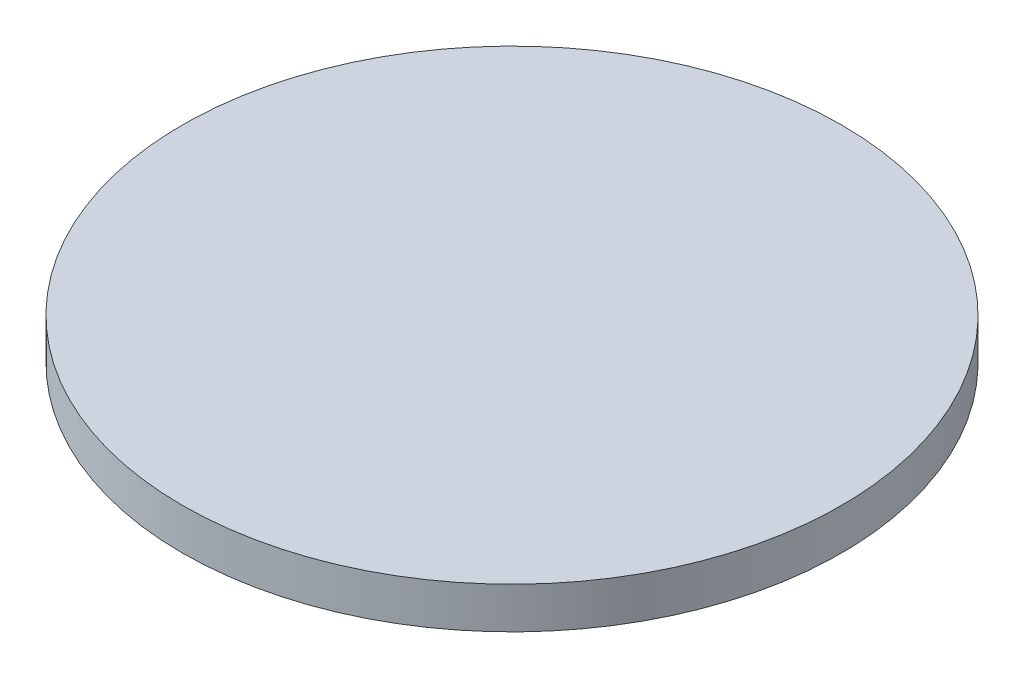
from build123d import *

# Parameters (mm, degrees)
SKETCH1_R      = 12.6746
EXTRUDE1_DEPTH = 1.5875


with BuildPart() as part:
    # Sketch1 → Extrude1 (new body)
    with BuildSketch(Plane(origin=(0, 0, 0), x_dir=(1, 0, 0), z_dir=(0, 1, 0))):
        with Locations(Location((0, 0, 0), (0, 0, 270))):
            Circle(SKETCH1_R)
    extrude(amount=EXTRUDE1_DEPTH)


solid = part.part
